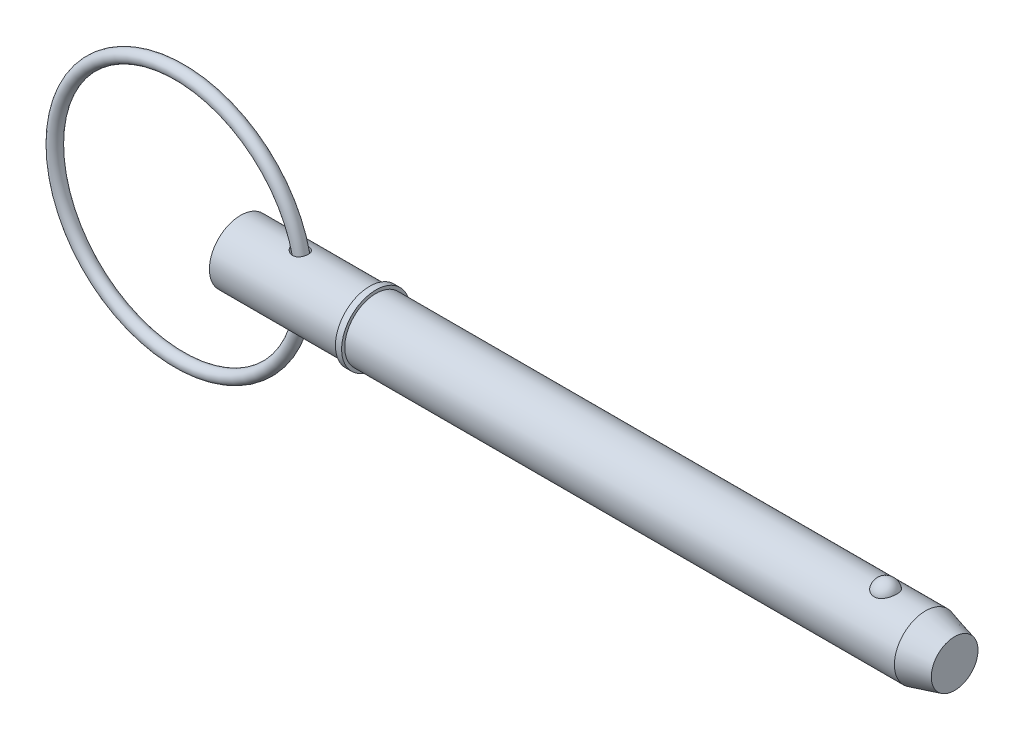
ISO-10303-21;
HEADER;
FILE_DESCRIPTION(('STEP AP214'),'2;1');
FILE_NAME('part.step','',(''),(''),'','','');
FILE_SCHEMA(('AUTOMOTIVE_DESIGN { 1 0 10303 214 1 1 1 1 }'));
ENDSEC;
DATA;
#1=APPLICATION_CONTEXT('core data for automotive mechanical design processes');
#2=APPLICATION_PROTOCOL_DEFINITION('international standard','automotive_design',2000,#1);
#3=PRODUCT_CONTEXT('',#1,'mechanical');
#4=PRODUCT('Part','Part','',(#3));
#5=PRODUCT_RELATED_PRODUCT_CATEGORY('part','',(#4));
#6=PRODUCT_DEFINITION_FORMATION('','',#4);
#7=PRODUCT_DEFINITION_CONTEXT('part definition',#1,'design');
#8=PRODUCT_DEFINITION('design','',#6,#7);
#9=PRODUCT_DEFINITION_SHAPE('','',#8);
#10=(LENGTH_UNIT() NAMED_UNIT(*) SI_UNIT(.MILLI.,.METRE.));
#11=(NAMED_UNIT(*) PLANE_ANGLE_UNIT() SI_UNIT($,.RADIAN.));
#12=(NAMED_UNIT(*) SI_UNIT($,.STERADIAN.) SOLID_ANGLE_UNIT());
#13=UNCERTAINTY_MEASURE_WITH_UNIT(LENGTH_MEASURE(1.E-05),#10,'distance_accuracy_value','');
#14=(GEOMETRIC_REPRESENTATION_CONTEXT(3) GLOBAL_UNCERTAINTY_ASSIGNED_CONTEXT((#13)) GLOBAL_UNIT_ASSIGNED_CONTEXT((#10,
#11,#12)) REPRESENTATION_CONTEXT('',''));
#15=CARTESIAN_POINT('',(0.,0.,0.));
#16=DIRECTION('',(0.,0.,1.));
#17=DIRECTION('',(1.,0.,0.));
#18=AXIS2_PLACEMENT_3D('',#15,#16,#17);
#19=CARTESIAN_POINT('',(-10.8860601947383,0.,0.));
#20=DIRECTION('',(0.,0.,1.));
#21=DIRECTION('',(1.,0.,0.));
#22=AXIS2_PLACEMENT_3D('',#19,#20,#21);
#23=TOROIDAL_SURFACE('',#22,22.225,1.111);
#24=CARTESIAN_POINT('',(12.4499398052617,0.,0.));
#25=VERTEX_POINT('',#24);
#26=VERTEX_LOOP('',#25);
#27=FACE_BOUND('',#26,.T.);
#28=ADVANCED_FACE('P0_F12',(#27),#23,.T.);
#29=CLOSED_SHELL('',(#28));
#30=MANIFOLD_SOLID_BREP('P0_B1',#29);
#31=CARTESIAN_POINT('',(0.,0.,0.));
#32=DIRECTION('',(1.,0.,0.));
#33=DIRECTION('',(0.,0.,-1.));
#34=AXIS2_PLACEMENT_3D('',#31,#32,#33);
#35=CYLINDRICAL_SURFACE('',#34,5.555);
#36=CARTESIAN_POINT('',(9.73108588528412,5.4531967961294,-1.05861687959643));
#37=CARTESIAN_POINT('',(9.79852417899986,5.4428857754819,-1.11173367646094));
#38=CARTESIAN_POINT('',(9.8705426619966,5.43287373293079,-1.15917228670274));
#39=CARTESIAN_POINT('',(10.0216706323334,5.41463354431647,-1.24159548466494));
#40=CARTESIAN_POINT('',(10.100788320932,5.40640749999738,-1.27656543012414));
#41=CARTESIAN_POINT('',(10.2640671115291,5.39277501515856,-1.33298568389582));
#42=CARTESIAN_POINT('',(10.3482338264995,5.38737178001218,-1.35442062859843));
#43=CARTESIAN_POINT('',(10.5191189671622,5.38018930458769,-1.38268153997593));
#44=CARTESIAN_POINT('',(10.6058357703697,5.37840780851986,-1.38951660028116));
#45=CARTESIAN_POINT('',(10.7759121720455,5.37883071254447,-1.38787777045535));
#46=CARTESIAN_POINT('',(10.8592768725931,5.38088957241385,-1.37996287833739));
#47=CARTESIAN_POINT('',(11.0231742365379,5.38856355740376,-1.34968531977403));
#48=CARTESIAN_POINT('',(11.1037078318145,5.39417750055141,-1.3273274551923));
#49=CARTESIAN_POINT('',(11.2542656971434,5.40784427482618,-1.27044672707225));
#50=CARTESIAN_POINT('',(11.3246325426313,5.41571997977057,-1.23678468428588));
#51=CARTESIAN_POINT('',(11.4584043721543,5.43310849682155,-1.15800564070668));
#52=CARTESIAN_POINT('',(11.5218100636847,5.44262114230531,-1.11288980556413));
#53=CARTESIAN_POINT('',(11.6387006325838,5.4619946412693,-1.01348173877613));
#54=CARTESIAN_POINT('',(11.6923567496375,5.47184490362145,-0.959388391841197));
#55=CARTESIAN_POINT('',(11.7899079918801,5.49098914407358,-0.842935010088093));
#56=CARTESIAN_POINT('',(11.8338027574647,5.5002831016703,-0.780574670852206));
#57=CARTESIAN_POINT('',(11.9111930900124,5.51740919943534,-0.648605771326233));
#58=CARTESIAN_POINT('',(11.944571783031,5.52522454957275,-0.578926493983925));
#59=CARTESIAN_POINT('',(11.9994972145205,5.5384271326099,-0.434834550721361));
#60=CARTESIAN_POINT('',(12.0210434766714,5.54381426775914,-0.360421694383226));
#61=CARTESIAN_POINT('',(12.0519313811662,5.55161917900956,-0.208311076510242));
#62=CARTESIAN_POINT('',(12.0611710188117,5.55401212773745,-0.130591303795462));
#63=CARTESIAN_POINT('',(12.0668974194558,5.55548938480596,0.025348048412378));
#64=CARTESIAN_POINT('',(12.0633840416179,5.55457365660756,0.103567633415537));
#65=CARTESIAN_POINT('',(12.0436796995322,5.54953010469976,0.258343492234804));
#66=CARTESIAN_POINT('',(12.0274798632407,5.54540003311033,0.334898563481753));
#67=CARTESIAN_POINT('',(11.9827711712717,5.53437033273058,0.484118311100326));
#68=CARTESIAN_POINT('',(11.9542620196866,5.52747063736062,0.556782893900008));
#69=CARTESIAN_POINT('',(11.8856108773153,5.51165296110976,0.696153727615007));
#70=CARTESIAN_POINT('',(11.8454690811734,5.50273501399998,0.762860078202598));
#71=CARTESIAN_POINT('',(11.7545317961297,5.48386724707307,0.888403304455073));
#72=CARTESIAN_POINT('',(11.7037367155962,5.47391746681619,0.94724048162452));
#73=CARTESIAN_POINT('',(11.5931044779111,5.45416351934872,1.05504470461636));
#74=CARTESIAN_POINT('',(11.533318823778,5.44435885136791,1.10406448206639));
#75=CARTESIAN_POINT('',(11.4061321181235,5.42595363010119,1.19123649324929));
#76=CARTESIAN_POINT('',(11.3387321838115,5.41735290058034,1.22939031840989));
#77=CARTESIAN_POINT('',(11.1991395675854,5.4024225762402,1.29341737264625));
#78=CARTESIAN_POINT('',(11.1270175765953,5.3960658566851,1.3194385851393));
#79=CARTESIAN_POINT('',(10.979323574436,5.38614405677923,1.35937634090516));
#80=CARTESIAN_POINT('',(10.9037515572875,5.38257898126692,1.37329286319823));
#81=CARTESIAN_POINT('',(10.7507722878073,5.37854282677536,1.38901730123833));
#82=CARTESIAN_POINT('',(10.6733560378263,5.37809300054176,1.39074204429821));
#83=CARTESIAN_POINT('',(10.5192388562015,5.38029043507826,1.38221411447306));
#84=CARTESIAN_POINT('',(10.4425381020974,5.38293844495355,1.37195854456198));
#85=CARTESIAN_POINT('',(10.2878936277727,5.39116673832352,1.33926960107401));
#86=CARTESIAN_POINT('',(10.2100819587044,5.3968880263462,1.31624874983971));
#87=CARTESIAN_POINT('',(10.0591420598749,5.4106466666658,1.25849276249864));
#88=CARTESIAN_POINT('',(9.98601576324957,5.41868496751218,1.22375282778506));
#89=CARTESIAN_POINT('',(9.84175565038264,5.43675805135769,1.14087469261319));
#90=CARTESIAN_POINT('',(9.77103801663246,5.44688674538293,1.09202994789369));
#91=CARTESIAN_POINT('',(9.63888287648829,5.46759592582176,0.983100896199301));
#92=CARTESIAN_POINT('',(9.57744762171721,5.47817652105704,0.923013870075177));
#93=CARTESIAN_POINT('',(9.4662044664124,5.49850106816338,0.792984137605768));
#94=CARTESIAN_POINT('',(9.4163677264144,5.5082470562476,0.723066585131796));
#95=CARTESIAN_POINT('',(9.33050546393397,5.52566389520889,0.574973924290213));
#96=CARTESIAN_POINT('',(9.29446727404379,5.53333664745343,0.496806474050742));
#97=CARTESIAN_POINT('',(9.24109888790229,5.54491199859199,0.342579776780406));
#98=CARTESIAN_POINT('',(9.22228936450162,5.54910883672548,0.26705568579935));
#99=CARTESIAN_POINT('',(9.19883437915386,5.55436306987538,0.113748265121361));
#100=CARTESIAN_POINT('',(9.19417820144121,5.55542284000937,0.0359666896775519));
#101=CARTESIAN_POINT('',(9.19905385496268,5.55432298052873,-0.111477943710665));
#102=CARTESIAN_POINT('',(9.20724428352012,5.55246769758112,-0.181191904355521));
#103=CARTESIAN_POINT('',(9.23493000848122,5.54630180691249,-0.318223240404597));
#104=CARTESIAN_POINT('',(9.25442702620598,5.54199082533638,-0.385540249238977));
#105=CARTESIAN_POINT('',(9.30387481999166,5.5313474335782,-0.516280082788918));
#106=CARTESIAN_POINT('',(9.33386163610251,5.52500806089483,-0.579688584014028));
#107=CARTESIAN_POINT('',(9.40305503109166,5.51092599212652,-0.701037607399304));
#108=CARTESIAN_POINT('',(9.44225922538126,5.50318365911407,-0.758979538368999));
#109=CARTESIAN_POINT('',(9.52133732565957,5.48833949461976,-0.859230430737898));
#110=CARTESIAN_POINT('',(9.55998996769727,5.48134889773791,-0.902529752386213));
#111=CARTESIAN_POINT('',(9.64209346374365,5.46725903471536,-0.984288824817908));
#112=CARTESIAN_POINT('',(9.68554534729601,5.46015974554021,-1.02274753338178));
#113=CARTESIAN_POINT('',(9.73108588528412,5.4531967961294,-1.05861687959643));
#114=B_SPLINE_CURVE_WITH_KNOTS('',3,(#36,#37,#38,#39,#40,#41,#42,#43,#44,#45,#46,#47,#48,#49,
#50,#51,#52,#53,#54,#55,#56,#57,#58,#59,#60,#61,#62,#63,#64,#65,#66,#67,#68,#69,#70,#71,#72,#73,
#74,#75,#76,#77,#78,#79,#80,#81,#82,#83,#84,#85,#86,#87,#88,#89,#90,#91,#92,#93,#94,#95,#96,#97,
#98,#99,#100,#101,#102,#103,#104,#105,#106,#107,#108,#109,#110,#111,#112,#113),.UNSPECIFIED.,
.T.,.F.,(4,2,2,2,2,2,2,2,2,2,2,2,2,2,2,2,2,2,2,2,2,2,2,2,2,2,2,2,2,2,2,2,2,2,2,2,2,2,4),(0.,
0.259176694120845,0.518656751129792,0.778430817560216,1.03804303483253,1.28801585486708,
1.53790560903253,1.77195750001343,2.00598558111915,2.23539047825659,2.4648038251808,
2.69668356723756,2.9285726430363,3.16237203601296,3.39617401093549,3.63013963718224,
3.86411088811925,4.09807822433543,4.33203659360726,4.56470246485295,4.79733424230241,
5.02704913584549,5.25676442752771,5.48804534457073,5.71938220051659,5.96237360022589,
6.20546461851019,6.46387943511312,6.72235683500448,6.98018450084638,7.23777490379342,
7.4702968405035,7.70264268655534,7.91229396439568,8.12197716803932,8.33238797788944,
8.54274441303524,8.71772674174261,8.89274668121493),.UNSPECIFIED.);
#115=CARTESIAN_POINT('',(9.73108588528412,5.4531967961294,-1.05861687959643));
#116=VERTEX_POINT('',#115);
#117=EDGE_CURVE('P1_E42',#116,#116,#114,.T.);
#118=ORIENTED_EDGE('',*,*,#117,.T.);
#119=EDGE_LOOP('',(#118));
#120=FACE_BOUND('',#119,.T.);
#121=CARTESIAN_POINT('',(0.,0.,0.));
#122=DIRECTION('',(1.,0.,0.));
#123=DIRECTION('',(0.,0.,-1.));
#124=AXIS2_PLACEMENT_3D('',#121,#122,#123);
#125=CIRCLE('',#124,5.555);
#126=CARTESIAN_POINT('',(0.,0.,-5.555));
#127=VERTEX_POINT('',#126);
#128=EDGE_CURVE('P1_E9',#127,#127,#125,.T.);
#129=ORIENTED_EDGE('',*,*,#128,.T.);
#130=EDGE_LOOP('',(#129));
#131=FACE_BOUND('',#130,.T.);
#132=CARTESIAN_POINT('',(23.019,0.,0.));
#133=DIRECTION('',(1.,0.,0.));
#134=DIRECTION('',(0.,0.,-1.));
#135=AXIS2_PLACEMENT_3D('',#132,#133,#134);
#136=CIRCLE('',#135,5.555);
#137=CARTESIAN_POINT('',(23.019,0.,-5.555));
#138=VERTEX_POINT('',#137);
#139=EDGE_CURVE('P1_E25',#138,#138,#136,.T.);
#140=ORIENTED_EDGE('',*,*,#139,.F.);
#141=EDGE_LOOP('',(#140));
#142=FACE_BOUND('',#141,.T.);
#143=CARTESIAN_POINT('',(9.73108588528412,-5.4531967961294,-1.05861687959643));
#144=CARTESIAN_POINT('',(9.66821110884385,-5.46281068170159,-1.00909184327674));
#145=CARTESIAN_POINT('',(9.60927221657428,-5.47269103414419,-0.954597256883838));
#146=CARTESIAN_POINT('',(9.50103698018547,-5.49196271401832,-0.836622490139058));
#147=CARTESIAN_POINT('',(9.45174193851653,-5.50135397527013,-0.773141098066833));
#148=CARTESIAN_POINT('',(9.36449982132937,-5.51864538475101,-0.638139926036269));
#149=CARTESIAN_POINT('',(9.32660692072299,-5.52653835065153,-0.566583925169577));
#150=CARTESIAN_POINT('',(9.26443740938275,-5.53978685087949,-0.417563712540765));
#151=CARTESIAN_POINT('',(9.24015003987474,-5.54514438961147,-0.34010422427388));
#152=CARTESIAN_POINT('',(9.20806696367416,-5.55228040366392,-0.188389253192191));
#153=CARTESIAN_POINT('',(9.19907227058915,-5.55431849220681,-0.114399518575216));
#154=CARTESIAN_POINT('',(9.19432225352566,-5.55539069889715,0.0340148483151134));
#155=CARTESIAN_POINT('',(9.19856204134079,-5.55442592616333,0.108439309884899));
#156=CARTESIAN_POINT('',(9.21926816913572,-5.54978420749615,0.250226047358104));
#157=CARTESIAN_POINT('',(9.2348766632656,-5.54629766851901,0.31772275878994));
#158=CARTESIAN_POINT('',(9.27656619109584,-5.53719805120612,0.449233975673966));
#159=CARTESIAN_POINT('',(9.3026486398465,-5.53158468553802,0.513248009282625));
#160=CARTESIAN_POINT('',(9.36540111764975,-5.51852259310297,0.63880901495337));
#161=CARTESIAN_POINT('',(9.40244578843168,-5.51101059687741,0.700161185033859));
#162=CARTESIAN_POINT('',(9.48531033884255,-5.49498546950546,0.816463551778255));
#163=CARTESIAN_POINT('',(9.5311337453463,-5.48647193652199,0.871411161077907));
#164=CARTESIAN_POINT('',(9.63549825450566,-5.46826315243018,0.979510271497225));
#165=CARTESIAN_POINT('',(9.69487291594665,-5.4585383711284,1.03185240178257));
#166=CARTESIAN_POINT('',(9.82107706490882,-5.43973797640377,1.12677509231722));
#167=CARTESIAN_POINT('',(9.8879103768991,-5.43066269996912,1.16935061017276));
#168=CARTESIAN_POINT('',(10.033391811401,-5.41336505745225,1.24708757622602));
#169=CARTESIAN_POINT('',(10.1125613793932,-5.40528106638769,1.28130933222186));
#170=CARTESIAN_POINT('',(10.2757060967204,-5.39196874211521,1.3362270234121));
#171=CARTESIAN_POINT('',(10.3596813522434,-5.38674047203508,1.35692265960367));
#172=CARTESIAN_POINT('',(10.5297702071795,-5.37991196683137,1.38375156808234));
#173=CARTESIAN_POINT('',(10.6158742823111,-5.37829778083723,1.38994084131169));
#174=CARTESIAN_POINT('',(10.7878226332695,-5.37901070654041,1.38718250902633));
#175=CARTESIAN_POINT('',(10.8736670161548,-5.38133587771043,1.37824235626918));
#176=CARTESIAN_POINT('',(11.0366214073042,-5.38945418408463,1.34612618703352));
#177=CARTESIAN_POINT('',(11.1139351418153,-5.39501006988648,1.32392147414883));
#178=CARTESIAN_POINT('',(11.2633246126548,-5.40877222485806,1.26652021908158));
#179=CARTESIAN_POINT('',(11.3354015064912,-5.41697790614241,1.23132655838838));
#180=CARTESIAN_POINT('',(11.4690899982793,-5.43466078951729,1.15069817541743));
#181=CARTESIAN_POINT('',(11.5310200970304,-5.4440673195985,1.10577441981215));
#182=CARTESIAN_POINT('',(11.6463540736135,-5.46335537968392,1.0061512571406));
#183=CARTESIAN_POINT('',(11.6997580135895,-5.47323690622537,0.951451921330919));
#184=CARTESIAN_POINT('',(11.7967319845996,-5.49239864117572,0.833747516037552));
#185=CARTESIAN_POINT('',(11.8402908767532,-5.50167816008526,0.770733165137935));
#186=CARTESIAN_POINT('',(11.9164538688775,-5.518621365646,0.638202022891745));
#187=CARTESIAN_POINT('',(11.9490573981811,-5.52628496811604,0.568684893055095));
#188=CARTESIAN_POINT('',(12.0028717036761,-5.53925911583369,0.424207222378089));
#189=CARTESIAN_POINT('',(12.023941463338,-5.54454040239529,0.349191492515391));
#190=CARTESIAN_POINT('',(12.053591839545,-5.55204602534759,0.196582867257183));
#191=CARTESIAN_POINT('',(12.0621722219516,-5.55427030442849,0.118989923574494));
#192=CARTESIAN_POINT('',(12.0666512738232,-5.55542602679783,-0.0368468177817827));
#193=CARTESIAN_POINT('',(12.0625074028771,-5.55434642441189,-0.11509192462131));
#194=CARTESIAN_POINT('',(12.0415418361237,-5.54898613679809,-0.269753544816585));
#195=CARTESIAN_POINT('',(12.0247199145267,-5.54470539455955,-0.346170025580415));
#196=CARTESIAN_POINT('',(11.9787920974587,-5.53340452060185,-0.495008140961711));
#197=CARTESIAN_POINT('',(11.9496857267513,-5.52638428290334,-0.56742962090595));
#198=CARTESIAN_POINT('',(11.8798787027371,-5.51036911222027,-0.706216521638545));
#199=CARTESIAN_POINT('',(11.8391779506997,-5.50137416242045,-0.772581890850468));
#200=CARTESIAN_POINT('',(11.7472553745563,-5.48242167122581,-0.897247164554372));
#201=CARTESIAN_POINT('',(11.6960515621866,-5.47246579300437,-0.955560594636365));
#202=CARTESIAN_POINT('',(11.5843994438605,-5.45270071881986,-1.06256643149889));
#203=CARTESIAN_POINT('',(11.5239521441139,-5.44289150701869,-1.11125988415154));
#204=CARTESIAN_POINT('',(11.396157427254,-5.42463941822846,-1.19717500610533));
#205=CARTESIAN_POINT('',(11.3288903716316,-5.41618309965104,-1.23451335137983));
#206=CARTESIAN_POINT('',(11.1888557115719,-5.40145691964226,-1.29743539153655));
#207=CARTESIAN_POINT('',(11.1160887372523,-5.39518680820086,-1.32302043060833));
#208=CARTESIAN_POINT('',(10.9677009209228,-5.38553131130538,-1.36179181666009));
#209=CARTESIAN_POINT('',(10.8921036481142,-5.38212602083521,-1.3750637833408));
#210=CARTESIAN_POINT('',(10.7396925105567,-5.37842027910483,-1.38948741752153));
#211=CARTESIAN_POINT('',(10.6628784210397,-5.37812040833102,-1.39063681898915));
#212=CARTESIAN_POINT('',(10.5077947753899,-5.38059635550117,-1.38102577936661));
#213=CARTESIAN_POINT('',(10.4295489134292,-5.3834629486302,-1.36991384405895));
#214=CARTESIAN_POINT('',(10.2758428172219,-5.3920092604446,-1.33587599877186));
#215=CARTESIAN_POINT('',(10.2003829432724,-5.39768934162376,-1.31294856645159));
#216=CARTESIAN_POINT('',(10.0559381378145,-5.4110281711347,-1.25682313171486));
#217=CARTESIAN_POINT('',(9.98683368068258,-5.41862962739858,-1.22391777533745));
#218=CARTESIAN_POINT('',(9.85432617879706,-5.43513913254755,-1.14838146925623));
#219=CARTESIAN_POINT('',(9.79092361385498,-5.44404729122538,-1.1057497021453));
#220=CARTESIAN_POINT('',(9.73108588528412,-5.4531967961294,-1.05861687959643));
#221=B_SPLINE_CURVE_WITH_KNOTS('',3,(#143,#144,#145,#146,#147,#148,#149,#150,#151,#152,#153,
#154,#155,#156,#157,#158,#159,#160,#161,#162,#163,#164,#165,#166,#167,#168,#169,#170,#171,#172,
#173,#174,#175,#176,#177,#178,#179,#180,#181,#182,#183,#184,#185,#186,#187,#188,#189,#190,#191,
#192,#193,#194,#195,#196,#197,#198,#199,#200,#201,#202,#203,#204,#205,#206,#207,#208,#209,#210,
#211,#212,#213,#214,#215,#216,#217,#218,#219,#220),.UNSPECIFIED.,.T.,.F.,(4,2,2,2,2,2,2,2,2,2,2,
2,2,2,2,2,2,2,2,2,2,2,2,2,2,2,2,2,2,2,2,2,2,2,2,2,2,2,4),(0.,0.241596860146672,
0.483226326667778,0.725986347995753,0.968554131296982,1.19103755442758,1.41343881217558,
1.62059806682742,1.82778531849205,2.04308674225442,2.25847484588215,2.4967195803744,
2.73508704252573,2.99374644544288,3.25241156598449,3.51007646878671,3.76761448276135,
4.00827541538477,4.24888299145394,4.47904430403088,4.70920393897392,4.93962269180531,
5.17005344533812,5.4032419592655,5.63643484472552,5.87040820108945,6.10438572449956,
6.33837230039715,6.57236086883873,6.80595147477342,7.03951667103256,7.27059385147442,
7.50164459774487,7.73107640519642,7.96055109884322,8.19677907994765,8.43303750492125,
8.66294515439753,8.89287213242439),.UNSPECIFIED.);
#222=CARTESIAN_POINT('',(9.73108588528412,-5.4531967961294,-1.05861687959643));
#223=VERTEX_POINT('',#222);
#224=EDGE_CURVE('P1_E17',#223,#223,#221,.T.);
#225=ORIENTED_EDGE('',*,*,#224,.T.);
#226=EDGE_LOOP('',(#225));
#227=FACE_BOUND('',#226,.T.);
#228=ADVANCED_FACE('P1_F13',(#120,#131,#142,#227),#35,.T.);
#229=CARTESIAN_POINT('',(0.,0.,0.));
#230=DIRECTION('',(1.,0.,0.));
#231=DIRECTION('',(0.,0.,-1.));
#232=AXIS2_PLACEMENT_3D('',#229,#230,#231);
#233=CYLINDRICAL_SURFACE('',#232,5.555);
#234=CARTESIAN_POINT('',(122.117114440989,0.,0.));
#235=DIRECTION('',(1.,0.,0.));
#236=DIRECTION('',(0.,0.,-1.));
#237=AXIS2_PLACEMENT_3D('',#234,#235,#236);
#238=CIRCLE('',#237,5.555);
#239=CARTESIAN_POINT('',(122.117114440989,0.,-5.555));
#240=VERTEX_POINT('',#239);
#241=EDGE_CURVE('P1_E99',#240,#240,#238,.T.);
#242=ORIENTED_EDGE('',*,*,#241,.F.);
#243=EDGE_LOOP('',(#242));
#244=FACE_BOUND('',#243,.T.);
#245=CARTESIAN_POINT('',(24.13,0.,0.));
#246=DIRECTION('',(1.,0.,0.));
#247=DIRECTION('',(0.,0.,-1.));
#248=AXIS2_PLACEMENT_3D('',#245,#246,#247);
#249=CIRCLE('',#248,5.555);
#250=CARTESIAN_POINT('',(24.13,0.,-5.555));
#251=VERTEX_POINT('',#250);
#252=EDGE_CURVE('P1_E96',#251,#251,#249,.T.);
#253=ORIENTED_EDGE('',*,*,#252,.T.);
#254=EDGE_LOOP('',(#253));
#255=FACE_BOUND('',#254,.T.);
#256=CARTESIAN_POINT('',(114.998626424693,5.16741224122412,2.03859650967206));
#257=CARTESIAN_POINT('',(114.892949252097,5.16740893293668,2.03859990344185));
#258=CARTESIAN_POINT('',(114.78729894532,5.17079470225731,2.03008306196));
#259=CARTESIAN_POINT('',(114.579141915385,5.18392795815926,1.99630721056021));
#260=CARTESIAN_POINT('',(114.476634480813,5.19367399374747,1.97105201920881));
#261=CARTESIAN_POINT('',(114.277771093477,5.21839168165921,1.90463997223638));
#262=CARTESIAN_POINT('',(114.181406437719,5.23335573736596,1.86350622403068));
#263=CARTESIAN_POINT('',(113.997080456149,5.26688076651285,1.76652592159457));
#264=CARTESIAN_POINT('',(113.909120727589,5.28544242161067,1.71067657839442));
#265=CARTESIAN_POINT('',(113.741265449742,5.32479845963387,1.58399959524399));
#266=CARTESIAN_POINT('',(113.66166564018,5.34564089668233,1.51279545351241));
#267=CARTESIAN_POINT('',(113.51512901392,5.38697258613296,1.35828584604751));
#268=CARTESIAN_POINT('',(113.448194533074,5.40746177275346,1.27497815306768));
#269=CARTESIAN_POINT('',(113.32561039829,5.44694508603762,1.09440293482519));
#270=CARTESIAN_POINT('',(113.270598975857,5.46583143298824,0.996677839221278));
#271=CARTESIAN_POINT('',(113.176937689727,5.49908030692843,0.792961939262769));
#272=CARTESIAN_POINT('',(113.138289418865,5.513442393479,0.6869703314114));
#273=CARTESIAN_POINT('',(113.077680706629,5.536358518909,0.468019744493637));
#274=CARTESIAN_POINT('',(113.055972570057,5.54482455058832,0.354981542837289));
#275=CARTESIAN_POINT('',(113.030636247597,5.55473324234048,0.126595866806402));
#276=CARTESIAN_POINT('',(113.027007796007,5.55617600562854,0.0112484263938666));
#277=CARTESIAN_POINT('',(113.037881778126,5.55189984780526,-0.218011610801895));
#278=CARTESIAN_POINT('',(113.052315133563,5.54620821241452,-0.331928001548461));
#279=CARTESIAN_POINT('',(113.098903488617,5.52828920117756,-0.555544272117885));
#280=CARTESIAN_POINT('',(113.131058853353,5.5160616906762,-0.66524406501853));
#281=CARTESIAN_POINT('',(113.212488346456,5.48630779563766,-0.877469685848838));
#282=CARTESIAN_POINT('',(113.261781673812,5.4687754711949,-0.97998731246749));
#283=CARTESIAN_POINT('',(113.376478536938,5.43024700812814,-1.17486975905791));
#284=CARTESIAN_POINT('',(113.441883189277,5.4092506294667,-1.26723387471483));
#285=CARTESIAN_POINT('',(113.587571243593,5.36600927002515,-1.43940133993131));
#286=CARTESIAN_POINT('',(113.667885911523,5.34376173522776,-1.51917763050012));
#287=CARTESIAN_POINT('',(113.841452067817,5.30057971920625,-1.66360338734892));
#288=CARTESIAN_POINT('',(113.934702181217,5.27964509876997,-1.72825445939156));
#289=CARTESIAN_POINT('',(114.129393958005,5.24205250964,-1.83909478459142));
#290=CARTESIAN_POINT('',(114.230590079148,5.22530519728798,-1.88568407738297));
#291=CARTESIAN_POINT('',(114.440155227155,5.1975091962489,-1.96100802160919));
#292=CARTESIAN_POINT('',(114.548521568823,5.1864583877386,-1.98974931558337));
#293=CARTESIAN_POINT('',(114.763498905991,5.17184410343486,-2.02742262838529));
#294=CARTESIAN_POINT('',(114.869925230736,5.1679328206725,-2.03727608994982));
#295=CARTESIAN_POINT('',(115.082992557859,5.16698995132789,-2.03966777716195));
#296=CARTESIAN_POINT('',(115.189633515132,5.16995704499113,-2.03220932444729));
#297=CARTESIAN_POINT('',(115.396773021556,5.18222383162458,-2.00071170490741));
#298=CARTESIAN_POINT('',(115.497359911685,5.19133213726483,-1.97717337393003));
#299=CARTESIAN_POINT('',(115.693014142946,5.21467637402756,-1.91475248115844));
#300=CARTESIAN_POINT('',(115.788081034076,5.22891272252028,-1.8758686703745));
#301=CARTESIAN_POINT('',(115.972371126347,5.26137066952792,-1.7828271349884));
#302=CARTESIAN_POINT('',(116.061419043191,5.27967329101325,-1.72835124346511));
#303=CARTESIAN_POINT('',(116.229288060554,5.31817411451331,-1.6059748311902));
#304=CARTESIAN_POINT('',(116.308106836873,5.33837274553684,-1.53807126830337));
#305=CARTESIAN_POINT('',(116.457515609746,5.37968287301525,-1.38688970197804));
#306=CARTESIAN_POINT('',(116.527505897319,5.40079011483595,-1.30301744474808));
#307=CARTESIAN_POINT('',(116.653012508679,5.44074401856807,-1.12458170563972));
#308=CARTESIAN_POINT('',(116.708526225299,5.4595902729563,-1.03001630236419));
#309=CARTESIAN_POINT('',(116.805550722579,5.49369849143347,-0.829439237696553));
#310=CARTESIAN_POINT('',(116.846548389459,5.50882422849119,-0.723155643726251));
#311=CARTESIAN_POINT('',(116.911125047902,5.53310911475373,-0.504772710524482));
#312=CARTESIAN_POINT('',(116.934703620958,5.54226812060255,-0.392673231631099));
#313=CARTESIAN_POINT('',(116.964013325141,5.55370358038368,-0.165459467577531));
#314=CARTESIAN_POINT('',(116.969688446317,5.55595843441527,-0.0503368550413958));
#315=CARTESIAN_POINT('',(116.962916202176,5.55329317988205,0.179288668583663));
#316=CARTESIAN_POINT('',(116.950469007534,5.54837313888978,0.293791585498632));
#317=CARTESIAN_POINT('',(116.907779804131,5.53189037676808,0.518526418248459));
#318=CARTESIAN_POINT('',(116.877598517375,5.5203503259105,0.628771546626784));
#319=CARTESIAN_POINT('',(116.800096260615,5.49182453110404,0.842318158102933));
#320=CARTESIAN_POINT('',(116.752774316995,5.47483847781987,0.945619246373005));
#321=CARTESIAN_POINT('',(116.641720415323,5.43710633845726,1.14281571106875));
#322=CARTESIAN_POINT('',(116.577921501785,5.41634501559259,1.23667048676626));
#323=CARTESIAN_POINT('',(116.435357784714,5.37334572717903,1.41185243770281));
#324=CARTESIAN_POINT('',(116.35659323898,5.35110778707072,1.4931798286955));
#325=CARTESIAN_POINT('',(116.186423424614,5.30779474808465,1.64049162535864));
#326=CARTESIAN_POINT('',(116.09510026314,5.28671324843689,1.7065687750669));
#327=CARTESIAN_POINT('',(115.901739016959,5.24804852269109,1.82201372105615));
#328=CARTESIAN_POINT('',(115.799700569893,5.23046541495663,1.87138095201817));
#329=CARTESIAN_POINT('',(115.583618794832,5.20042692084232,1.95335298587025));
#330=CARTESIAN_POINT('',(115.469260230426,5.18820192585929,1.98521734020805));
#331=CARTESIAN_POINT('',(115.236130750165,5.17169804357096,2.02783294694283));
#332=CARTESIAN_POINT('',(115.117361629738,5.16741595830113,2.03859269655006));
#333=CARTESIAN_POINT('',(114.998626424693,5.16741224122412,2.03859650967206));
#334=B_SPLINE_CURVE_WITH_KNOTS('',3,(#256,#257,#258,#259,#260,#261,#262,#263,#264,#265,#266,
#267,#268,#269,#270,#271,#272,#273,#274,#275,#276,#277,#278,#279,#280,#281,#282,#283,#284,#285,
#286,#287,#288,#289,#290,#291,#292,#293,#294,#295,#296,#297,#298,#299,#300,#301,#302,#303,#304,
#305,#306,#307,#308,#309,#310,#311,#312,#313,#314,#315,#316,#317,#318,#319,#320,#321,#322,#323,
#324,#325,#326,#327,#328,#329,#330,#331,#332,#333),.UNSPECIFIED.,.T.,.F.,(4,2,2,2,2,2,2,2,2,2,2,
2,2,2,2,2,2,2,2,2,2,2,2,2,2,2,2,2,2,2,2,2,2,2,2,2,2,2,4),(0.,0.316595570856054,
0.633118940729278,0.949183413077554,1.26530783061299,1.59030762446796,1.91536729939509,
2.25495824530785,2.59458224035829,2.93917283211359,3.28375835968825,3.62703002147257,
3.97030875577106,4.31397329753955,4.65766166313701,5.0020790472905,5.34645984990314,
5.68270547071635,6.01882587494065,6.33808403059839,6.65728093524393,6.96696376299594,
7.27667180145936,7.59321535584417,7.909830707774,8.24210387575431,8.57443684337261,
8.91755896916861,9.2606893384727,9.60489211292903,9.94909164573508,10.2921194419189,
10.6351667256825,10.9796305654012,11.3240884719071,11.6663928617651,12.0087088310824,
12.3645679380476,12.7202837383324),.UNSPECIFIED.);
#335=CARTESIAN_POINT('',(114.998626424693,5.16741224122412,2.03859650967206));
#336=VERTEX_POINT('',#335);
#337=EDGE_CURVE('P1_E34',#336,#336,#334,.T.);
#338=ORIENTED_EDGE('',*,*,#337,.T.);
#339=EDGE_LOOP('',(#338));
#340=FACE_BOUND('',#339,.T.);
#341=ADVANCED_FACE('P1_F46',(#244,#255,#340),#233,.T.);
#342=CARTESIAN_POINT('',(0.,0.,0.));
#343=DIRECTION('',(-1.,0.,0.));
#344=DIRECTION('',(0.,0.,1.));
#345=AXIS2_PLACEMENT_3D('',#342,#343,#344);
#346=PLANE('',#345);
#347=ORIENTED_EDGE('',*,*,#128,.F.);
#348=EDGE_LOOP('',(#347));
#349=FACE_BOUND('',#348,.T.);
#350=ADVANCED_FACE('P1_F15',(#349),#346,.T.);
#351=CARTESIAN_POINT('',(23.019,5.555,0.));
#352=DIRECTION('',(-1.,0.,0.));
#353=DIRECTION('',(0.,0.,1.));
#354=AXIS2_PLACEMENT_3D('',#351,#352,#353);
#355=PLANE('',#354);
#356=ORIENTED_EDGE('',*,*,#139,.T.);
#357=EDGE_LOOP('',(#356));
#358=FACE_BOUND('',#357,.T.);
#359=CARTESIAN_POINT('',(23.019,0.,0.));
#360=DIRECTION('',(1.,0.,0.));
#361=DIRECTION('',(0.,0.,-1.));
#362=AXIS2_PLACEMENT_3D('',#359,#360,#361);
#363=CIRCLE('',#362,6.1105);
#364=CARTESIAN_POINT('',(23.019,0.,-6.1105));
#365=VERTEX_POINT('',#364);
#366=EDGE_CURVE('P1_E30',#365,#365,#363,.T.);
#367=ORIENTED_EDGE('',*,*,#366,.F.);
#368=EDGE_LOOP('',(#367));
#369=FACE_BOUND('',#368,.T.);
#370=ADVANCED_FACE('P1_F81',(#358,#369),#355,.T.);
#371=CARTESIAN_POINT('',(0.,0.,0.));
#372=DIRECTION('',(1.,0.,0.));
#373=DIRECTION('',(0.,0.,-1.));
#374=AXIS2_PLACEMENT_3D('',#371,#372,#373);
#375=CYLINDRICAL_SURFACE('',#374,6.1105);
#376=ORIENTED_EDGE('',*,*,#366,.T.);
#377=EDGE_LOOP('',(#376));
#378=FACE_BOUND('',#377,.T.);
#379=CARTESIAN_POINT('',(24.13,0.,0.));
#380=DIRECTION('',(1.,0.,0.));
#381=DIRECTION('',(0.,0.,-1.));
#382=AXIS2_PLACEMENT_3D('',#379,#380,#381);
#383=CIRCLE('',#382,6.1105);
#384=CARTESIAN_POINT('',(24.13,0.,-6.1105));
#385=VERTEX_POINT('',#384);
#386=EDGE_CURVE('P1_E95',#385,#385,#383,.T.);
#387=ORIENTED_EDGE('',*,*,#386,.F.);
#388=EDGE_LOOP('',(#387));
#389=FACE_BOUND('',#388,.T.);
#390=ADVANCED_FACE('P1_F68',(#378,#389),#375,.T.);
#391=CARTESIAN_POINT('',(24.13,6.1105,0.));
#392=DIRECTION('',(1.,0.,0.));
#393=DIRECTION('',(0.,0.,-1.));
#394=AXIS2_PLACEMENT_3D('',#391,#392,#393);
#395=PLANE('',#394);
#396=ORIENTED_EDGE('',*,*,#386,.T.);
#397=EDGE_LOOP('',(#396));
#398=FACE_BOUND('',#397,.T.);
#399=ORIENTED_EDGE('',*,*,#252,.F.);
#400=EDGE_LOOP('',(#399));
#401=FACE_BOUND('',#400,.T.);
#402=ADVANCED_FACE('P1_F62',(#398,#401),#395,.T.);
#403=CARTESIAN_POINT('',(127.3,0.,0.));
#404=DIRECTION('',(-1.,0.,0.));
#405=DIRECTION('',(0.,0.,1.));
#406=AXIS2_PLACEMENT_3D('',#403,#404,#405);
#407=CONICAL_SURFACE('',#406,4.16625000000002,0.261799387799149);
#408=ORIENTED_EDGE('',*,*,#241,.T.);
#409=EDGE_LOOP('',(#408));
#410=FACE_BOUND('',#409,.T.);
#411=CARTESIAN_POINT('',(127.3,0.,0.));
#412=DIRECTION('',(1.,0.,0.));
#413=DIRECTION('',(0.,0.,-1.));
#414=AXIS2_PLACEMENT_3D('',#411,#412,#413);
#415=CIRCLE('',#414,4.16625000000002);
#416=CARTESIAN_POINT('',(127.3,0.,-4.16625000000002));
#417=VERTEX_POINT('',#416);
#418=EDGE_CURVE('P1_E41',#417,#417,#415,.T.);
#419=ORIENTED_EDGE('',*,*,#418,.F.);
#420=EDGE_LOOP('',(#419));
#421=FACE_BOUND('',#420,.T.);
#422=ADVANCED_FACE('P1_F59',(#410,#421),#407,.T.);
#423=CARTESIAN_POINT('',(127.3,4.16625000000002,0.));
#424=DIRECTION('',(1.,0.,0.));
#425=DIRECTION('',(0.,0.,-1.));
#426=AXIS2_PLACEMENT_3D('',#423,#424,#425);
#427=PLANE('',#426);
#428=ORIENTED_EDGE('',*,*,#418,.T.);
#429=EDGE_LOOP('',(#428));
#430=FACE_BOUND('',#429,.T.);
#431=ADVANCED_FACE('P1_F55',(#430),#427,.T.);
#432=CARTESIAN_POINT('',(114.998626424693,4.99949999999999,0.));
#433=DIRECTION('',(-1.,0.,0.));
#434=DIRECTION('',(0.,1.,0.));
#435=AXIS2_PLACEMENT_3D('',#432,#433,#434);
#436=SPHERICAL_SURFACE('',#435,2.04550000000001);
#437=ORIENTED_EDGE('',*,*,#337,.F.);
#438=EDGE_LOOP('',(#437));
#439=FACE_BOUND('',#438,.T.);
#440=ADVANCED_FACE('P1_F50',(#439),#436,.T.);
#441=CARTESIAN_POINT('',(-10.8860601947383,0.,0.));
#442=DIRECTION('',(0.,0.,1.));
#443=DIRECTION('',(1.,0.,0.));
#444=AXIS2_PLACEMENT_3D('',#441,#442,#443);
#445=TOROIDAL_SURFACE('',#444,22.225,1.38875);
#446=ORIENTED_EDGE('',*,*,#224,.F.);
#447=EDGE_LOOP('',(#446));
#448=FACE_BOUND('',#447,.T.);
#449=ORIENTED_EDGE('',*,*,#117,.F.);
#450=EDGE_LOOP('',(#449));
#451=FACE_BOUND('',#450,.T.);
#452=ADVANCED_FACE('P1_F54',(#448,#451),#445,.F.);
#453=CLOSED_SHELL('',(#228,#341,#350,#370,#390,#402,#422,#431,#440,#452));
#454=MANIFOLD_SOLID_BREP('P1_B1',#453);
#455=ADVANCED_BREP_SHAPE_REPRESENTATION('',(#18,#30,#454),#14);
#456=SHAPE_DEFINITION_REPRESENTATION(#9,#455);
ENDSEC;
END-ISO-10303-21;
